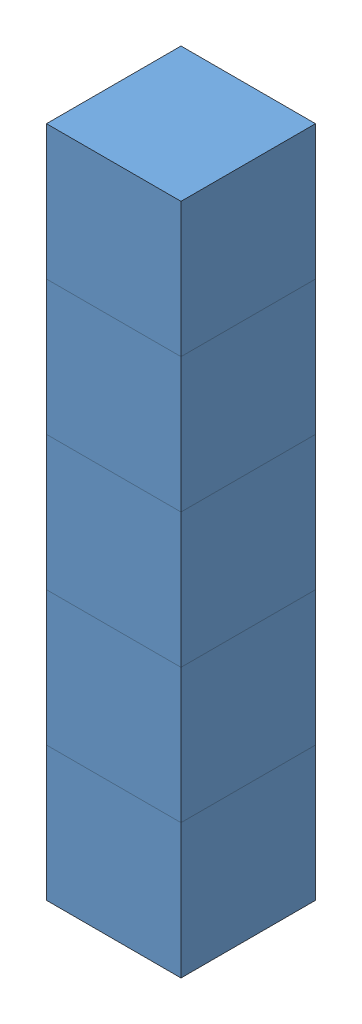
SolidWorks assembly Assem3.sldasm, configuration Default (file format 9000). Lengths in mm.
Overall size (50.8 254 50.8).
5 component instances, 1 part files, 13 mates.
Components (placement in the parent):
- 2 in Yellow Hard Foam Cube-1: 2 in Yellow Hard Foam Cube.SLDPRT [Default] at (20.2395 0 39.9337) size (50.8 50.8 50.8)
- 2 in Yellow Hard Foam Cube-2: 2 in Yellow Hard Foam Cube.SLDPRT [Default] at (20.2395 50.8 39.9337) size (50.8 50.8 50.8)
- 2 in Yellow Hard Foam Cube-3: 2 in Yellow Hard Foam Cube.SLDPRT [Default] at (20.2395 101.6 39.9337) size (50.8 50.8 50.8)
- 2 in Yellow Hard Foam Cube-4: 2 in Yellow Hard Foam Cube.SLDPRT [Default] at (20.2395 152.4 39.9337) size (50.8 50.8 50.8)
- 2 in Yellow Hard Foam Cube-5: 2 in Yellow Hard Foam Cube.SLDPRT [Default] at (20.2395 203.2 39.9337) size (50.8 50.8 50.8)
Mates (geometry in assembly coordinates):
- Coincident2: coincident anti-aligned: plane of 2 in Yellow Hard Foam Cube-1 through (20.2395 0 39.9337) normal (0 -1 0); plane of assembly
- Coincident3: coincident anti-aligned: plane of 2 in Yellow Hard Foam Cube-1 through (20.2395 50.8 39.9337) normal (0 1 0); plane of 2 in Yellow Hard Foam Cube-2 through (20.2395 50.8 39.9337) normal (0 -1 0)
- Coincident4: coincident anti-aligned: plane of 2 in Yellow Hard Foam Cube-2 through (20.2395 101.6 39.9337) normal (0 1 0); plane of 2 in Yellow Hard Foam Cube-3 through (20.2395 101.6 39.9337) normal (0 -1 0)
- Coincident5: coincident anti-aligned: plane of 2 in Yellow Hard Foam Cube-3 through (20.2395 152.4 39.9337) normal (0 1 0); plane of 2 in Yellow Hard Foam Cube-4 through (20.2395 152.4 39.9337) normal (0 -1 0)
- Coincident6: coincident: plane of 2 in Yellow Hard Foam Cube-4 through (20.2395 203.2 39.9337) normal (0 1 0); plane of 2 in Yellow Hard Foam Cube-5 through (20.2395 203.2 39.9337) normal (0 -1 0)
- Coincident7: coincident aligned: plane of 2 in Yellow Hard Foam Cube-1 through (-5.1605 50.8 14.5337) normal (-1 0 0); plane of 2 in Yellow Hard Foam Cube-2 through (-5.1605 101.6 14.5337) normal (-1 0 0)
- Coincident8: coincident aligned: plane of 2 in Yellow Hard Foam Cube-2 through (-5.1605 101.6 14.5337) normal (-1 0 0); plane of 2 in Yellow Hard Foam Cube-3 through (-5.1605 152.4 14.5337) normal (-1 0 0)
- Coincident9: coincident aligned: plane of 2 in Yellow Hard Foam Cube-3 through (-5.1605 152.4 14.5337) normal (-1 0 0); plane of 2 in Yellow Hard Foam Cube-4 through (-5.1605 203.2 14.5337) normal (-1 0 0)
- Coincident10: coincident: plane of 2 in Yellow Hard Foam Cube-4 through (-5.1605 203.2 14.5337) normal (-1 0 0); plane of 2 in Yellow Hard Foam Cube-5 through (-5.1605 254 14.5337) normal (-1 0 0)
- Coincident11: coincident aligned: plane of 2 in Yellow Hard Foam Cube-1 through (-5.1605 50.8 65.3337) normal (0 0 1); plane of 2 in Yellow Hard Foam Cube-2 through (-5.1605 101.6 65.3337) normal (0 0 1)
- Coincident12: coincident aligned: plane of 2 in Yellow Hard Foam Cube-2 through (-5.1605 101.6 65.3337) normal (0 0 1); plane of 2 in Yellow Hard Foam Cube-3 through (-5.1605 152.4 65.3337) normal (0 0 1)
- Coincident13: coincident aligned: plane of 2 in Yellow Hard Foam Cube-3 through (-5.1605 152.4 65.3337) normal (0 0 1); plane of 2 in Yellow Hard Foam Cube-4 through (-5.1605 203.2 65.3337) normal (0 0 1)
- Coincident14: coincident aligned: plane of 2 in Yellow Hard Foam Cube-4 through (-5.1605 203.2 65.3337) normal (0 0 1); plane of 2 in Yellow Hard Foam Cube-5 through (-5.1605 254 65.3337) normal (0 0 1)
